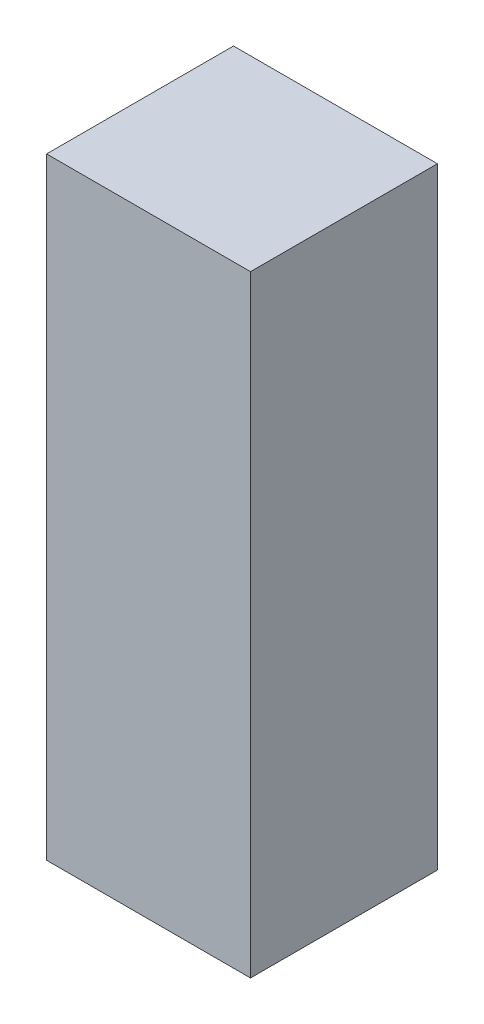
ISO-10303-21;
HEADER;
FILE_DESCRIPTION(('STEP AP214'),'2;1');
FILE_NAME('part.step','',(''),(''),'','','');
FILE_SCHEMA(('AUTOMOTIVE_DESIGN { 1 0 10303 214 1 1 1 1 }'));
ENDSEC;
DATA;
#1=APPLICATION_CONTEXT('core data for automotive mechanical design processes');
#2=APPLICATION_PROTOCOL_DEFINITION('international standard','automotive_design',2000,#1);
#3=PRODUCT_CONTEXT('',#1,'mechanical');
#4=PRODUCT('Part','Part','',(#3));
#5=PRODUCT_RELATED_PRODUCT_CATEGORY('part','',(#4));
#6=PRODUCT_DEFINITION_FORMATION('','',#4);
#7=PRODUCT_DEFINITION_CONTEXT('part definition',#1,'design');
#8=PRODUCT_DEFINITION('design','',#6,#7);
#9=PRODUCT_DEFINITION_SHAPE('','',#8);
#10=(LENGTH_UNIT() NAMED_UNIT(*) SI_UNIT(.MILLI.,.METRE.));
#11=(NAMED_UNIT(*) PLANE_ANGLE_UNIT() SI_UNIT($,.RADIAN.));
#12=(NAMED_UNIT(*) SI_UNIT($,.STERADIAN.) SOLID_ANGLE_UNIT());
#13=UNCERTAINTY_MEASURE_WITH_UNIT(LENGTH_MEASURE(1.E-05),#10,'distance_accuracy_value','');
#14=(GEOMETRIC_REPRESENTATION_CONTEXT(3) GLOBAL_UNCERTAINTY_ASSIGNED_CONTEXT((#13)) GLOBAL_UNIT_ASSIGNED_CONTEXT((#10,
#11,#12)) REPRESENTATION_CONTEXT('',''));
#15=CARTESIAN_POINT('',(0.,0.,0.));
#16=DIRECTION('',(0.,0.,1.));
#17=DIRECTION('',(1.,0.,0.));
#18=AXIS2_PLACEMENT_3D('',#15,#16,#17);
#19=CARTESIAN_POINT('',(304.8,1828.8,-279.4));
#20=DIRECTION('',(-1.,0.,0.));
#21=DIRECTION('',(0.,0.,1.));
#22=AXIS2_PLACEMENT_3D('',#19,#20,#21);
#23=PLANE('',#22);
#24=DIRECTION('',(0.,0.,-1.));
#25=VECTOR('',#24,1.);
#26=CARTESIAN_POINT('',(304.8,0.,-279.4));
#27=LINE('',#26,#25);
#28=CARTESIAN_POINT('',(304.8,0.,279.4));
#29=VERTEX_POINT('',#28);
#30=CARTESIAN_POINT('',(304.8,0.,-279.4));
#31=VERTEX_POINT('',#30);
#32=EDGE_CURVE('E96',#29,#31,#27,.T.);
#33=ORIENTED_EDGE('',*,*,#32,.T.);
#34=DIRECTION('',(0.,-1.,0.));
#35=VECTOR('',#34,1.);
#36=CARTESIAN_POINT('',(304.8,1828.8,-279.4));
#37=LINE('',#36,#35);
#38=CARTESIAN_POINT('',(304.8,1828.8,-279.4));
#39=VERTEX_POINT('',#38);
#40=EDGE_CURVE('E11',#39,#31,#37,.T.);
#41=ORIENTED_EDGE('',*,*,#40,.F.);
#42=DIRECTION('',(0.,0.,-1.));
#43=VECTOR('',#42,1.);
#44=CARTESIAN_POINT('',(304.8,1828.8,-279.4));
#45=LINE('',#44,#43);
#46=CARTESIAN_POINT('',(304.8,1828.8,279.4));
#47=VERTEX_POINT('',#46);
#48=EDGE_CURVE('E84',#47,#39,#45,.T.);
#49=ORIENTED_EDGE('',*,*,#48,.F.);
#50=DIRECTION('',(0.,-1.,0.));
#51=VECTOR('',#50,1.);
#52=CARTESIAN_POINT('',(304.8,1828.8,279.4));
#53=LINE('',#52,#51);
#54=EDGE_CURVE('E92',#47,#29,#53,.T.);
#55=ORIENTED_EDGE('',*,*,#54,.T.);
#56=EDGE_LOOP('',(#33,#41,#49,#55));
#57=FACE_BOUND('',#56,.T.);
#58=ADVANCED_FACE('F33',(#57),#23,.F.);
#59=CARTESIAN_POINT('',(-304.8,1828.8,-279.4));
#60=DIRECTION('',(0.,0.,1.));
#61=DIRECTION('',(1.,0.,0.));
#62=AXIS2_PLACEMENT_3D('',#59,#60,#61);
#63=PLANE('',#62);
#64=DIRECTION('',(-1.,0.,0.));
#65=VECTOR('',#64,1.);
#66=CARTESIAN_POINT('',(-304.8,0.,-279.4));
#67=LINE('',#66,#65);
#68=CARTESIAN_POINT('',(-304.8,0.,-279.4));
#69=VERTEX_POINT('',#68);
#70=EDGE_CURVE('E88',#31,#69,#67,.T.);
#71=ORIENTED_EDGE('',*,*,#70,.T.);
#72=DIRECTION('',(0.,-1.,0.));
#73=VECTOR('',#72,1.);
#74=CARTESIAN_POINT('',(-304.8,1828.8,-279.4));
#75=LINE('',#74,#73);
#76=CARTESIAN_POINT('',(-304.8,1828.8,-279.4));
#77=VERTEX_POINT('',#76);
#78=EDGE_CURVE('E41',#77,#69,#75,.T.);
#79=ORIENTED_EDGE('',*,*,#78,.F.);
#80=DIRECTION('',(-1.,0.,0.));
#81=VECTOR('',#80,1.);
#82=CARTESIAN_POINT('',(-304.8,1828.8,-279.4));
#83=LINE('',#82,#81);
#84=EDGE_CURVE('E79',#39,#77,#83,.T.);
#85=ORIENTED_EDGE('',*,*,#84,.F.);
#86=ORIENTED_EDGE('',*,*,#40,.T.);
#87=EDGE_LOOP('',(#71,#79,#85,#86));
#88=FACE_BOUND('',#87,.T.);
#89=ADVANCED_FACE('F87',(#88),#63,.F.);
#90=CARTESIAN_POINT('',(-304.8,1828.8,-279.4));
#91=DIRECTION('',(1.,0.,0.));
#92=DIRECTION('',(0.,0.,-1.));
#93=AXIS2_PLACEMENT_3D('',#90,#91,#92);
#94=PLANE('',#93);
#95=DIRECTION('',(0.,0.,1.));
#96=VECTOR('',#95,1.);
#97=CARTESIAN_POINT('',(-304.8,0.,-279.4));
#98=LINE('',#97,#96);
#99=CARTESIAN_POINT('',(-304.8,0.,279.4));
#100=VERTEX_POINT('',#99);
#101=EDGE_CURVE('E66',#69,#100,#98,.T.);
#102=ORIENTED_EDGE('',*,*,#101,.T.);
#103=DIRECTION('',(0.,-1.,0.));
#104=VECTOR('',#103,1.);
#105=CARTESIAN_POINT('',(-304.8,1828.8,279.4));
#106=LINE('',#105,#104);
#107=CARTESIAN_POINT('',(-304.8,1828.8,279.4));
#108=VERTEX_POINT('',#107);
#109=EDGE_CURVE('E89',#108,#100,#106,.T.);
#110=ORIENTED_EDGE('',*,*,#109,.F.);
#111=DIRECTION('',(0.,0.,1.));
#112=VECTOR('',#111,1.);
#113=CARTESIAN_POINT('',(-304.8,1828.8,-279.4));
#114=LINE('',#113,#112);
#115=EDGE_CURVE('E82',#77,#108,#114,.T.);
#116=ORIENTED_EDGE('',*,*,#115,.F.);
#117=ORIENTED_EDGE('',*,*,#78,.T.);
#118=EDGE_LOOP('',(#102,#110,#116,#117));
#119=FACE_BOUND('',#118,.T.);
#120=ADVANCED_FACE('F90',(#119),#94,.F.);
#121=CARTESIAN_POINT('',(-304.8,1828.8,279.4));
#122=DIRECTION('',(0.,0.,-1.));
#123=DIRECTION('',(-1.,0.,0.));
#124=AXIS2_PLACEMENT_3D('',#121,#122,#123);
#125=PLANE('',#124);
#126=DIRECTION('',(1.,0.,0.));
#127=VECTOR('',#126,1.);
#128=CARTESIAN_POINT('',(-304.8,0.,279.4));
#129=LINE('',#128,#127);
#130=EDGE_CURVE('E72',#100,#29,#129,.T.);
#131=ORIENTED_EDGE('',*,*,#130,.T.);
#132=ORIENTED_EDGE('',*,*,#54,.F.);
#133=DIRECTION('',(1.,0.,0.));
#134=VECTOR('',#133,1.);
#135=CARTESIAN_POINT('',(-304.8,1828.8,279.4));
#136=LINE('',#135,#134);
#137=EDGE_CURVE('E49',#108,#47,#136,.T.);
#138=ORIENTED_EDGE('',*,*,#137,.F.);
#139=ORIENTED_EDGE('',*,*,#109,.T.);
#140=EDGE_LOOP('',(#131,#132,#138,#139));
#141=FACE_BOUND('',#140,.T.);
#142=ADVANCED_FACE('F103',(#141),#125,.F.);
#143=CARTESIAN_POINT('',(0.,1828.8,0.));
#144=DIRECTION('',(0.,1.,0.));
#145=DIRECTION('',(0.,0.,1.));
#146=AXIS2_PLACEMENT_3D('',#143,#144,#145);
#147=PLANE('',#146);
#148=ORIENTED_EDGE('',*,*,#48,.T.);
#149=ORIENTED_EDGE('',*,*,#84,.T.);
#150=ORIENTED_EDGE('',*,*,#115,.T.);
#151=ORIENTED_EDGE('',*,*,#137,.T.);
#152=EDGE_LOOP('',(#148,#149,#150,#151));
#153=FACE_BOUND('',#152,.T.);
#154=ADVANCED_FACE('F80',(#153),#147,.T.);
#155=CARTESIAN_POINT('',(0.,0.,0.));
#156=DIRECTION('',(0.,1.,0.));
#157=DIRECTION('',(0.,0.,1.));
#158=AXIS2_PLACEMENT_3D('',#155,#156,#157);
#159=PLANE('',#158);
#160=ORIENTED_EDGE('',*,*,#32,.F.);
#161=ORIENTED_EDGE('',*,*,#130,.F.);
#162=ORIENTED_EDGE('',*,*,#101,.F.);
#163=ORIENTED_EDGE('',*,*,#70,.F.);
#164=EDGE_LOOP('',(#160,#161,#162,#163));
#165=FACE_BOUND('',#164,.T.);
#166=ADVANCED_FACE('F106',(#165),#159,.F.);
#167=CLOSED_SHELL('',(#58,#89,#120,#142,#154,#166));
#168=MANIFOLD_SOLID_BREP('B2',#167);
#169=ADVANCED_BREP_SHAPE_REPRESENTATION('',(#18,#168),#14);
#170=SHAPE_DEFINITION_REPRESENTATION(#9,#169);
ENDSEC;
END-ISO-10303-21;
